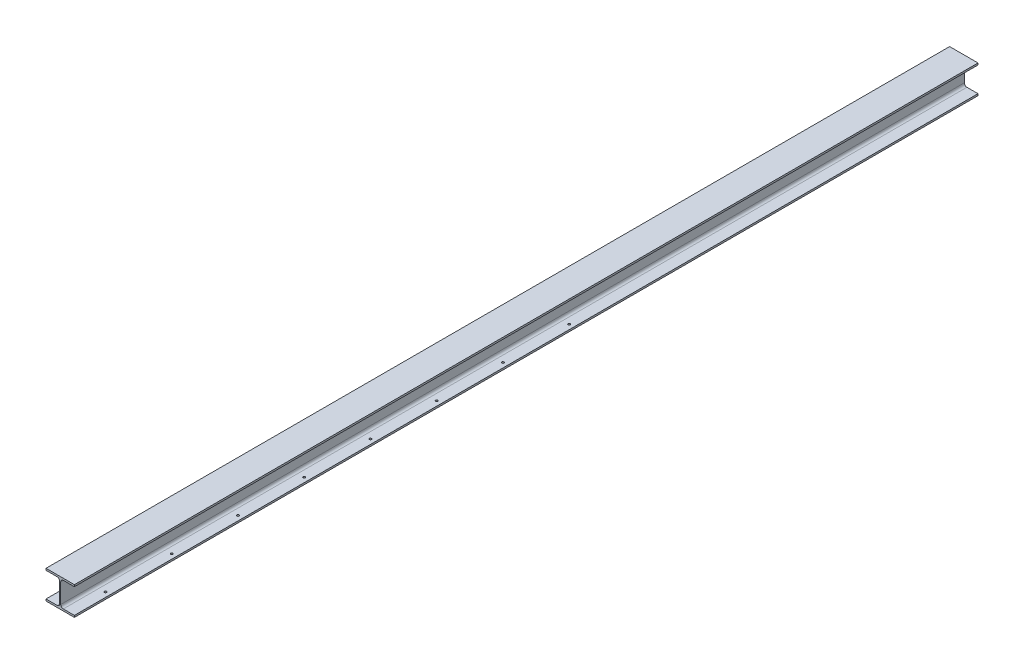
ISO-10303-21;
HEADER;
FILE_DESCRIPTION(('STEP AP214'),'2;1');
FILE_NAME('part.step','',(''),(''),'','','');
FILE_SCHEMA(('AUTOMOTIVE_DESIGN { 1 0 10303 214 1 1 1 1 }'));
ENDSEC;
DATA;
#1=APPLICATION_CONTEXT('core data for automotive mechanical design processes');
#2=APPLICATION_PROTOCOL_DEFINITION('international standard','automotive_design',2000,#1);
#3=PRODUCT_CONTEXT('',#1,'mechanical');
#4=PRODUCT('Part','Part','',(#3));
#5=PRODUCT_RELATED_PRODUCT_CATEGORY('part','',(#4));
#6=PRODUCT_DEFINITION_FORMATION('','',#4);
#7=PRODUCT_DEFINITION_CONTEXT('part definition',#1,'design');
#8=PRODUCT_DEFINITION('design','',#6,#7);
#9=PRODUCT_DEFINITION_SHAPE('','',#8);
#10=(LENGTH_UNIT() NAMED_UNIT(*) SI_UNIT(.MILLI.,.METRE.));
#11=(NAMED_UNIT(*) PLANE_ANGLE_UNIT() SI_UNIT($,.RADIAN.));
#12=(NAMED_UNIT(*) SI_UNIT($,.STERADIAN.) SOLID_ANGLE_UNIT());
#13=UNCERTAINTY_MEASURE_WITH_UNIT(LENGTH_MEASURE(1.E-05),#10,'distance_accuracy_value','');
#14=(GEOMETRIC_REPRESENTATION_CONTEXT(3) GLOBAL_UNCERTAINTY_ASSIGNED_CONTEXT((#13)) GLOBAL_UNIT_ASSIGNED_CONTEXT((#10,
#11,#12)) REPRESENTATION_CONTEXT('',''));
#15=CARTESIAN_POINT('',(0.,0.,0.));
#16=DIRECTION('',(0.,0.,1.));
#17=DIRECTION('',(1.,0.,0.));
#18=AXIS2_PLACEMENT_3D('',#15,#16,#17);
#19=CARTESIAN_POINT('',(150.,19.0000000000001,4775.));
#20=DIRECTION('',(0.,-1.,0.));
#21=DIRECTION('',(1.,0.,0.));
#22=AXIS2_PLACEMENT_3D('',#19,#20,#21);
#23=PLANE('',#22);
#24=CARTESIAN_POINT('',(100.000000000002,19.0000000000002,-504.001924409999));
#25=DIRECTION('',(0.,-1.,0.));
#26=DIRECTION('',(1.,0.,0.));
#27=AXIS2_PLACEMENT_3D('',#24,#25,#26);
#28=CIRCLE('',#27,11.0000000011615);
#29=CARTESIAN_POINT('',(111.000000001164,19.0000000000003,-504.001924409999));
#30=VERTEX_POINT('',#29);
#31=EDGE_CURVE('E345',#30,#30,#28,.F.);
#32=ORIENTED_EDGE('',*,*,#31,.F.);
#33=EDGE_LOOP('',(#32));
#34=FACE_BOUND('',#33,.T.);
#35=CARTESIAN_POINT('',(100.000000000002,19.0000000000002,195.998075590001));
#36=DIRECTION('',(0.,-1.,0.));
#37=DIRECTION('',(1.,0.,0.));
#38=AXIS2_PLACEMENT_3D('',#35,#36,#37);
#39=CIRCLE('',#38,11.0000000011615);
#40=CARTESIAN_POINT('',(111.000000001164,19.0000000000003,195.998075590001));
#41=VERTEX_POINT('',#40);
#42=EDGE_CURVE('E349',#41,#41,#39,.F.);
#43=ORIENTED_EDGE('',*,*,#42,.F.);
#44=EDGE_LOOP('',(#43));
#45=FACE_BOUND('',#44,.T.);
#46=CARTESIAN_POINT('',(100.000000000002,19.0000000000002,895.998075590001));
#47=DIRECTION('',(0.,-1.,0.));
#48=DIRECTION('',(1.,0.,0.));
#49=AXIS2_PLACEMENT_3D('',#46,#47,#48);
#50=CIRCLE('',#49,11.0000000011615);
#51=CARTESIAN_POINT('',(111.000000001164,19.0000000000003,895.998075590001));
#52=VERTEX_POINT('',#51);
#53=EDGE_CURVE('E353',#52,#52,#50,.F.);
#54=ORIENTED_EDGE('',*,*,#53,.F.);
#55=EDGE_LOOP('',(#54));
#56=FACE_BOUND('',#55,.T.);
#57=CARTESIAN_POINT('',(100.000000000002,19.0000000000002,1595.99807559));
#58=DIRECTION('',(0.,-1.,0.));
#59=DIRECTION('',(1.,0.,0.));
#60=AXIS2_PLACEMENT_3D('',#57,#58,#59);
#61=CIRCLE('',#60,11.0000000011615);
#62=CARTESIAN_POINT('',(111.000000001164,19.0000000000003,1595.99807559));
#63=VERTEX_POINT('',#62);
#64=EDGE_CURVE('E357',#63,#63,#61,.F.);
#65=ORIENTED_EDGE('',*,*,#64,.F.);
#66=EDGE_LOOP('',(#65));
#67=FACE_BOUND('',#66,.T.);
#68=CARTESIAN_POINT('',(100.000000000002,19.0000000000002,2295.99807559));
#69=DIRECTION('',(0.,-1.,0.));
#70=DIRECTION('',(1.,0.,0.));
#71=AXIS2_PLACEMENT_3D('',#68,#69,#70);
#72=CIRCLE('',#71,11.0000000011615);
#73=CARTESIAN_POINT('',(111.000000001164,19.0000000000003,2295.99807559));
#74=VERTEX_POINT('',#73);
#75=EDGE_CURVE('E361',#74,#74,#72,.F.);
#76=ORIENTED_EDGE('',*,*,#75,.F.);
#77=EDGE_LOOP('',(#76));
#78=FACE_BOUND('',#77,.T.);
#79=CARTESIAN_POINT('',(100.000000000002,19.0000000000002,2995.99807559));
#80=DIRECTION('',(0.,-1.,0.));
#81=DIRECTION('',(1.,0.,0.));
#82=AXIS2_PLACEMENT_3D('',#79,#80,#81);
#83=CIRCLE('',#82,11.0000000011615);
#84=CARTESIAN_POINT('',(111.000000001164,19.0000000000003,2995.99807559));
#85=VERTEX_POINT('',#84);
#86=EDGE_CURVE('E365',#85,#85,#83,.F.);
#87=ORIENTED_EDGE('',*,*,#86,.F.);
#88=EDGE_LOOP('',(#87));
#89=FACE_BOUND('',#88,.T.);
#90=CARTESIAN_POINT('',(100.000000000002,19.0000000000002,3695.99807559));
#91=DIRECTION('',(0.,-1.,0.));
#92=DIRECTION('',(1.,0.,0.));
#93=AXIS2_PLACEMENT_3D('',#90,#91,#92);
#94=CIRCLE('',#93,11.0000000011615);
#95=CARTESIAN_POINT('',(111.000000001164,19.0000000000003,3695.99807559));
#96=VERTEX_POINT('',#95);
#97=EDGE_CURVE('E369',#96,#96,#94,.F.);
#98=ORIENTED_EDGE('',*,*,#97,.F.);
#99=EDGE_LOOP('',(#98));
#100=FACE_BOUND('',#99,.T.);
#101=CARTESIAN_POINT('',(100.000000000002,19.0000000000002,4395.99807559));
#102=DIRECTION('',(0.,-1.,0.));
#103=DIRECTION('',(1.,0.,0.));
#104=AXIS2_PLACEMENT_3D('',#101,#102,#103);
#105=CIRCLE('',#104,11.0000000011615);
#106=CARTESIAN_POINT('',(111.000000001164,19.0000000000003,4395.99807559));
#107=VERTEX_POINT('',#106);
#108=EDGE_CURVE('E372',#107,#107,#105,.F.);
#109=ORIENTED_EDGE('',*,*,#108,.F.);
#110=EDGE_LOOP('',(#109));
#111=FACE_BOUND('',#110,.T.);
#112=DIRECTION('',(-1.,0.,0.));
#113=VECTOR('',#112,1.);
#114=CARTESIAN_POINT('',(150.,19.0000000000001,-4775.));
#115=LINE('',#114,#113);
#116=CARTESIAN_POINT('',(150.,19.0000000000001,-4775.));
#117=VERTEX_POINT('',#116);
#118=CARTESIAN_POINT('',(32.5,19.0000000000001,-4775.));
#119=VERTEX_POINT('',#118);
#120=EDGE_CURVE('E145',#117,#119,#115,.T.);
#121=ORIENTED_EDGE('',*,*,#120,.T.);
#122=DIRECTION('',(0.,0.,-1.));
#123=VECTOR('',#122,1.);
#124=CARTESIAN_POINT('',(32.5,19.0000000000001,4775.));
#125=LINE('',#124,#123);
#126=CARTESIAN_POINT('',(32.5,19.0000000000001,4775.));
#127=VERTEX_POINT('',#126);
#128=EDGE_CURVE('E11',#127,#119,#125,.T.);
#129=ORIENTED_EDGE('',*,*,#128,.F.);
#130=DIRECTION('',(-1.,0.,0.));
#131=VECTOR('',#130,1.);
#132=CARTESIAN_POINT('',(150.,19.0000000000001,4775.));
#133=LINE('',#132,#131);
#134=CARTESIAN_POINT('',(150.,19.0000000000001,4775.));
#135=VERTEX_POINT('',#134);
#136=EDGE_CURVE('E193',#135,#127,#133,.T.);
#137=ORIENTED_EDGE('',*,*,#136,.F.);
#138=DIRECTION('',(0.,0.,-1.));
#139=VECTOR('',#138,1.);
#140=CARTESIAN_POINT('',(150.,19.0000000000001,4775.));
#141=LINE('',#140,#139);
#142=EDGE_CURVE('E158',#135,#117,#141,.T.);
#143=ORIENTED_EDGE('',*,*,#142,.T.);
#144=EDGE_LOOP('',(#121,#129,#137,#143));
#145=FACE_BOUND('',#144,.T.);
#146=ADVANCED_FACE('F29',(#34,#45,#56,#67,#78,#89,#100,#111,#145),#23,.F.);
#147=CARTESIAN_POINT('',(32.5,46.0000000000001,4775.));
#148=DIRECTION('',(0.,0.,-1.));
#149=DIRECTION('',(-1.,0.,0.));
#150=AXIS2_PLACEMENT_3D('',#147,#148,#149);
#151=CYLINDRICAL_SURFACE('',#150,27.);
#152=CARTESIAN_POINT('',(32.5,46.0000000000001,-4775.));
#153=DIRECTION('',(0.,0.,-1.));
#154=DIRECTION('',(-1.,0.,0.));
#155=AXIS2_PLACEMENT_3D('',#152,#153,#154);
#156=CIRCLE('',#155,27.);
#157=CARTESIAN_POINT('',(5.49999999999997,46.0000000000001,-4775.));
#158=VERTEX_POINT('',#157);
#159=EDGE_CURVE('E141',#119,#158,#156,.T.);
#160=ORIENTED_EDGE('',*,*,#159,.T.);
#161=DIRECTION('',(0.,0.,-1.));
#162=VECTOR('',#161,1.);
#163=CARTESIAN_POINT('',(5.49999999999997,46.0000000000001,4775.));
#164=LINE('',#163,#162);
#165=CARTESIAN_POINT('',(5.49999999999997,46.0000000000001,4775.));
#166=VERTEX_POINT('',#165);
#167=EDGE_CURVE('E36',#166,#158,#164,.T.);
#168=ORIENTED_EDGE('',*,*,#167,.F.);
#169=CARTESIAN_POINT('',(32.5,46.0000000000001,4775.));
#170=DIRECTION('',(0.,0.,-1.));
#171=DIRECTION('',(-1.,0.,0.));
#172=AXIS2_PLACEMENT_3D('',#169,#170,#171);
#173=CIRCLE('',#172,27.);
#174=EDGE_CURVE('E154',#127,#166,#173,.T.);
#175=ORIENTED_EDGE('',*,*,#174,.F.);
#176=ORIENTED_EDGE('',*,*,#128,.T.);
#177=EDGE_LOOP('',(#160,#168,#175,#176));
#178=FACE_BOUND('',#177,.T.);
#179=ADVANCED_FACE('F153',(#178),#151,.F.);
#180=CARTESIAN_POINT('',(5.49999999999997,46.0000000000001,4775.));
#181=DIRECTION('',(-1.,0.,0.));
#182=DIRECTION('',(0.,0.,1.));
#183=AXIS2_PLACEMENT_3D('',#180,#181,#182);
#184=PLANE('',#183);
#185=DIRECTION('',(0.,1.,0.));
#186=VECTOR('',#185,1.);
#187=CARTESIAN_POINT('',(5.49999999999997,46.0000000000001,-4775.));
#188=LINE('',#187,#186);
#189=CARTESIAN_POINT('',(5.49999999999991,254.,-4775.));
#190=VERTEX_POINT('',#189);
#191=EDGE_CURVE('E147',#158,#190,#188,.T.);
#192=ORIENTED_EDGE('',*,*,#191,.T.);
#193=DIRECTION('',(0.,0.,-1.));
#194=VECTOR('',#193,1.);
#195=CARTESIAN_POINT('',(5.49999999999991,254.,4775.));
#196=LINE('',#195,#194);
#197=CARTESIAN_POINT('',(5.49999999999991,254.,4775.));
#198=VERTEX_POINT('',#197);
#199=EDGE_CURVE('E259',#198,#190,#196,.T.);
#200=ORIENTED_EDGE('',*,*,#199,.F.);
#201=DIRECTION('',(0.,1.,0.));
#202=VECTOR('',#201,1.);
#203=CARTESIAN_POINT('',(5.49999999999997,46.0000000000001,4775.));
#204=LINE('',#203,#202);
#205=EDGE_CURVE('E196',#166,#198,#204,.T.);
#206=ORIENTED_EDGE('',*,*,#205,.F.);
#207=ORIENTED_EDGE('',*,*,#167,.T.);
#208=EDGE_LOOP('',(#192,#200,#206,#207));
#209=FACE_BOUND('',#208,.T.);
#210=ADVANCED_FACE('F263',(#209),#184,.F.);
#211=CARTESIAN_POINT('',(32.4999999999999,254.,4775.));
#212=DIRECTION('',(0.,0.,-1.));
#213=DIRECTION('',(-1.,0.,0.));
#214=AXIS2_PLACEMENT_3D('',#211,#212,#213);
#215=CYLINDRICAL_SURFACE('',#214,27.);
#216=CARTESIAN_POINT('',(32.4999999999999,254.,-4775.));
#217=DIRECTION('',(0.,0.,-1.));
#218=DIRECTION('',(1.,0.,0.));
#219=AXIS2_PLACEMENT_3D('',#216,#217,#218);
#220=CIRCLE('',#219,27.);
#221=CARTESIAN_POINT('',(32.4999999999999,281.,-4775.));
#222=VERTEX_POINT('',#221);
#223=EDGE_CURVE('E167',#190,#222,#220,.T.);
#224=ORIENTED_EDGE('',*,*,#223,.T.);
#225=DIRECTION('',(0.,0.,-1.));
#226=VECTOR('',#225,1.);
#227=CARTESIAN_POINT('',(32.4999999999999,281.,4775.));
#228=LINE('',#227,#226);
#229=CARTESIAN_POINT('',(32.4999999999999,281.,4775.));
#230=VERTEX_POINT('',#229);
#231=EDGE_CURVE('E256',#230,#222,#228,.T.);
#232=ORIENTED_EDGE('',*,*,#231,.F.);
#233=CARTESIAN_POINT('',(32.4999999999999,254.,4775.));
#234=DIRECTION('',(0.,0.,-1.));
#235=DIRECTION('',(1.,0.,0.));
#236=AXIS2_PLACEMENT_3D('',#233,#234,#235);
#237=CIRCLE('',#236,27.);
#238=EDGE_CURVE('E198',#198,#230,#237,.T.);
#239=ORIENTED_EDGE('',*,*,#238,.F.);
#240=ORIENTED_EDGE('',*,*,#199,.T.);
#241=EDGE_LOOP('',(#224,#232,#239,#240));
#242=FACE_BOUND('',#241,.T.);
#243=ADVANCED_FACE('F271',(#242),#215,.F.);
#244=CARTESIAN_POINT('',(32.4999999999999,281.,4775.));
#245=DIRECTION('',(0.,1.,0.));
#246=DIRECTION('',(0.,0.,1.));
#247=AXIS2_PLACEMENT_3D('',#244,#245,#246);
#248=PLANE('',#247);
#249=DIRECTION('',(1.,0.,0.));
#250=VECTOR('',#249,1.);
#251=CARTESIAN_POINT('',(32.4999999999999,281.,-4775.));
#252=LINE('',#251,#250);
#253=CARTESIAN_POINT('',(150.,281.,-4775.));
#254=VERTEX_POINT('',#253);
#255=EDGE_CURVE('E169',#222,#254,#252,.T.);
#256=ORIENTED_EDGE('',*,*,#255,.T.);
#257=DIRECTION('',(0.,0.,-1.));
#258=VECTOR('',#257,1.);
#259=CARTESIAN_POINT('',(150.,281.,4775.));
#260=LINE('',#259,#258);
#261=CARTESIAN_POINT('',(150.,281.,4775.));
#262=VERTEX_POINT('',#261);
#263=EDGE_CURVE('E253',#262,#254,#260,.T.);
#264=ORIENTED_EDGE('',*,*,#263,.F.);
#265=DIRECTION('',(1.,0.,0.));
#266=VECTOR('',#265,1.);
#267=CARTESIAN_POINT('',(32.4999999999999,281.,4775.));
#268=LINE('',#267,#266);
#269=EDGE_CURVE('E200',#230,#262,#268,.T.);
#270=ORIENTED_EDGE('',*,*,#269,.F.);
#271=ORIENTED_EDGE('',*,*,#231,.T.);
#272=EDGE_LOOP('',(#256,#264,#270,#271));
#273=FACE_BOUND('',#272,.T.);
#274=ADVANCED_FACE('F274',(#273),#248,.F.);
#275=CARTESIAN_POINT('',(150.,281.,4775.));
#276=DIRECTION('',(-1.,0.,0.));
#277=DIRECTION('',(0.,-1.,0.));
#278=AXIS2_PLACEMENT_3D('',#275,#276,#277);
#279=PLANE('',#278);
#280=DIRECTION('',(0.,1.,0.));
#281=VECTOR('',#280,1.);
#282=CARTESIAN_POINT('',(150.,281.,-4775.));
#283=LINE('',#282,#281);
#284=CARTESIAN_POINT('',(150.,300.,-4775.));
#285=VERTEX_POINT('',#284);
#286=EDGE_CURVE('E171',#254,#285,#283,.T.);
#287=ORIENTED_EDGE('',*,*,#286,.T.);
#288=DIRECTION('',(0.,0.,-1.));
#289=VECTOR('',#288,1.);
#290=CARTESIAN_POINT('',(150.,300.,4775.));
#291=LINE('',#290,#289);
#292=CARTESIAN_POINT('',(150.,300.,4775.));
#293=VERTEX_POINT('',#292);
#294=EDGE_CURVE('E250',#293,#285,#291,.T.);
#295=ORIENTED_EDGE('',*,*,#294,.F.);
#296=DIRECTION('',(0.,1.,0.));
#297=VECTOR('',#296,1.);
#298=CARTESIAN_POINT('',(150.,281.,4775.));
#299=LINE('',#298,#297);
#300=EDGE_CURVE('E202',#262,#293,#299,.T.);
#301=ORIENTED_EDGE('',*,*,#300,.F.);
#302=ORIENTED_EDGE('',*,*,#263,.T.);
#303=EDGE_LOOP('',(#287,#295,#301,#302));
#304=FACE_BOUND('',#303,.T.);
#305=ADVANCED_FACE('F279',(#304),#279,.F.);
#306=CARTESIAN_POINT('',(150.,300.,4775.));
#307=DIRECTION('',(0.,-1.,0.));
#308=DIRECTION('',(0.,0.,-1.));
#309=AXIS2_PLACEMENT_3D('',#306,#307,#308);
#310=PLANE('',#309);
#311=DIRECTION('',(-1.,0.,0.));
#312=VECTOR('',#311,1.);
#313=CARTESIAN_POINT('',(150.,300.,-4775.));
#314=LINE('',#313,#312);
#315=CARTESIAN_POINT('',(-150.,300.,-4775.));
#316=VERTEX_POINT('',#315);
#317=EDGE_CURVE('E173',#285,#316,#314,.T.);
#318=ORIENTED_EDGE('',*,*,#317,.T.);
#319=DIRECTION('',(0.,0.,-1.));
#320=VECTOR('',#319,1.);
#321=CARTESIAN_POINT('',(-150.,300.,4775.));
#322=LINE('',#321,#320);
#323=CARTESIAN_POINT('',(-150.,300.,4775.));
#324=VERTEX_POINT('',#323);
#325=EDGE_CURVE('E247',#324,#316,#322,.T.);
#326=ORIENTED_EDGE('',*,*,#325,.F.);
#327=DIRECTION('',(-1.,0.,0.));
#328=VECTOR('',#327,1.);
#329=CARTESIAN_POINT('',(150.,300.,4775.));
#330=LINE('',#329,#328);
#331=EDGE_CURVE('E204',#293,#324,#330,.T.);
#332=ORIENTED_EDGE('',*,*,#331,.F.);
#333=ORIENTED_EDGE('',*,*,#294,.T.);
#334=EDGE_LOOP('',(#318,#326,#332,#333));
#335=FACE_BOUND('',#334,.T.);
#336=ADVANCED_FACE('F285',(#335),#310,.F.);
#337=CARTESIAN_POINT('',(-150.,281.,4775.));
#338=DIRECTION('',(1.,0.,0.));
#339=DIRECTION('',(0.,1.,0.));
#340=AXIS2_PLACEMENT_3D('',#337,#338,#339);
#341=PLANE('',#340);
#342=DIRECTION('',(0.,-1.,0.));
#343=VECTOR('',#342,1.);
#344=CARTESIAN_POINT('',(-150.,281.,-4775.));
#345=LINE('',#344,#343);
#346=CARTESIAN_POINT('',(-150.,281.,-4775.));
#347=VERTEX_POINT('',#346);
#348=EDGE_CURVE('E175',#316,#347,#345,.T.);
#349=ORIENTED_EDGE('',*,*,#348,.T.);
#350=DIRECTION('',(0.,0.,-1.));
#351=VECTOR('',#350,1.);
#352=CARTESIAN_POINT('',(-150.,281.,4775.));
#353=LINE('',#352,#351);
#354=CARTESIAN_POINT('',(-150.,281.,4775.));
#355=VERTEX_POINT('',#354);
#356=EDGE_CURVE('E244',#355,#347,#353,.T.);
#357=ORIENTED_EDGE('',*,*,#356,.F.);
#358=DIRECTION('',(0.,-1.,0.));
#359=VECTOR('',#358,1.);
#360=CARTESIAN_POINT('',(-150.,281.,4775.));
#361=LINE('',#360,#359);
#362=EDGE_CURVE('E206',#324,#355,#361,.T.);
#363=ORIENTED_EDGE('',*,*,#362,.F.);
#364=ORIENTED_EDGE('',*,*,#325,.T.);
#365=EDGE_LOOP('',(#349,#357,#363,#364));
#366=FACE_BOUND('',#365,.T.);
#367=ADVANCED_FACE('F289',(#366),#341,.F.);
#368=CARTESIAN_POINT('',(-32.5000000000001,281.,4775.));
#369=DIRECTION('',(0.,1.,0.));
#370=DIRECTION('',(-1.,0.,0.));
#371=AXIS2_PLACEMENT_3D('',#368,#369,#370);
#372=PLANE('',#371);
#373=DIRECTION('',(1.,0.,0.));
#374=VECTOR('',#373,1.);
#375=CARTESIAN_POINT('',(-32.5000000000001,281.,-4775.));
#376=LINE('',#375,#374);
#377=CARTESIAN_POINT('',(-32.5000000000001,281.,-4775.));
#378=VERTEX_POINT('',#377);
#379=EDGE_CURVE('E177',#347,#378,#376,.T.);
#380=ORIENTED_EDGE('',*,*,#379,.T.);
#381=DIRECTION('',(0.,0.,-1.));
#382=VECTOR('',#381,1.);
#383=CARTESIAN_POINT('',(-32.5000000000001,281.,4775.));
#384=LINE('',#383,#382);
#385=CARTESIAN_POINT('',(-32.5000000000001,281.,4775.));
#386=VERTEX_POINT('',#385);
#387=EDGE_CURVE('E241',#386,#378,#384,.T.);
#388=ORIENTED_EDGE('',*,*,#387,.F.);
#389=DIRECTION('',(1.,0.,0.));
#390=VECTOR('',#389,1.);
#391=CARTESIAN_POINT('',(-32.5000000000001,281.,4775.));
#392=LINE('',#391,#390);
#393=EDGE_CURVE('E208',#355,#386,#392,.T.);
#394=ORIENTED_EDGE('',*,*,#393,.F.);
#395=ORIENTED_EDGE('',*,*,#356,.T.);
#396=EDGE_LOOP('',(#380,#388,#394,#395));
#397=FACE_BOUND('',#396,.T.);
#398=ADVANCED_FACE('F294',(#397),#372,.F.);
#399=CARTESIAN_POINT('',(-32.5000000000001,254.,4775.));
#400=DIRECTION('',(0.,0.,-1.));
#401=DIRECTION('',(-1.,0.,0.));
#402=AXIS2_PLACEMENT_3D('',#399,#400,#401);
#403=CYLINDRICAL_SURFACE('',#402,27.);
#404=CARTESIAN_POINT('',(-32.5000000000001,254.,-4775.));
#405=DIRECTION('',(0.,0.,-1.));
#406=DIRECTION('',(1.,0.,0.));
#407=AXIS2_PLACEMENT_3D('',#404,#405,#406);
#408=CIRCLE('',#407,27.);
#409=CARTESIAN_POINT('',(-5.50000000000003,254.,-4775.));
#410=VERTEX_POINT('',#409);
#411=EDGE_CURVE('E179',#378,#410,#408,.T.);
#412=ORIENTED_EDGE('',*,*,#411,.T.);
#413=DIRECTION('',(0.,0.,-1.));
#414=VECTOR('',#413,1.);
#415=CARTESIAN_POINT('',(-5.50000000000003,254.,4775.));
#416=LINE('',#415,#414);
#417=CARTESIAN_POINT('',(-5.50000000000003,254.,4775.));
#418=VERTEX_POINT('',#417);
#419=EDGE_CURVE('E238',#418,#410,#416,.T.);
#420=ORIENTED_EDGE('',*,*,#419,.F.);
#421=CARTESIAN_POINT('',(-32.5000000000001,254.,4775.));
#422=DIRECTION('',(0.,0.,-1.));
#423=DIRECTION('',(1.,0.,0.));
#424=AXIS2_PLACEMENT_3D('',#421,#422,#423);
#425=CIRCLE('',#424,27.);
#426=EDGE_CURVE('E210',#386,#418,#425,.T.);
#427=ORIENTED_EDGE('',*,*,#426,.F.);
#428=ORIENTED_EDGE('',*,*,#387,.T.);
#429=EDGE_LOOP('',(#412,#420,#427,#428));
#430=FACE_BOUND('',#429,.T.);
#431=ADVANCED_FACE('F300',(#430),#403,.F.);
#432=CARTESIAN_POINT('',(-5.50000000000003,46.0000000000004,4775.));
#433=DIRECTION('',(1.,0.,0.));
#434=DIRECTION('',(0.,0.,-1.));
#435=AXIS2_PLACEMENT_3D('',#432,#433,#434);
#436=PLANE('',#435);
#437=DIRECTION('',(0.,-1.,0.));
#438=VECTOR('',#437,1.);
#439=CARTESIAN_POINT('',(-5.50000000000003,46.0000000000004,-4775.));
#440=LINE('',#439,#438);
#441=CARTESIAN_POINT('',(-5.50000000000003,46.0000000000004,-4775.));
#442=VERTEX_POINT('',#441);
#443=EDGE_CURVE('E181',#410,#442,#440,.T.);
#444=ORIENTED_EDGE('',*,*,#443,.T.);
#445=DIRECTION('',(0.,0.,-1.));
#446=VECTOR('',#445,1.);
#447=CARTESIAN_POINT('',(-5.50000000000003,46.0000000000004,4775.));
#448=LINE('',#447,#446);
#449=CARTESIAN_POINT('',(-5.50000000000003,46.0000000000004,4775.));
#450=VERTEX_POINT('',#449);
#451=EDGE_CURVE('E235',#450,#442,#448,.T.);
#452=ORIENTED_EDGE('',*,*,#451,.F.);
#453=DIRECTION('',(0.,-1.,0.));
#454=VECTOR('',#453,1.);
#455=CARTESIAN_POINT('',(-5.50000000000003,46.0000000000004,4775.));
#456=LINE('',#455,#454);
#457=EDGE_CURVE('E212',#418,#450,#456,.T.);
#458=ORIENTED_EDGE('',*,*,#457,.F.);
#459=ORIENTED_EDGE('',*,*,#419,.T.);
#460=EDGE_LOOP('',(#444,#452,#458,#459));
#461=FACE_BOUND('',#460,.T.);
#462=ADVANCED_FACE('F304',(#461),#436,.F.);
#463=CARTESIAN_POINT('',(-32.5,46.0000000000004,4775.));
#464=DIRECTION('',(0.,0.,-1.));
#465=DIRECTION('',(-1.,0.,0.));
#466=AXIS2_PLACEMENT_3D('',#463,#464,#465);
#467=CYLINDRICAL_SURFACE('',#466,27.);
#468=CARTESIAN_POINT('',(-32.5,46.0000000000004,-4775.));
#469=DIRECTION('',(0.,0.,-1.));
#470=DIRECTION('',(1.,0.,0.));
#471=AXIS2_PLACEMENT_3D('',#468,#469,#470);
#472=CIRCLE('',#471,27.);
#473=CARTESIAN_POINT('',(-32.4999999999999,19.0000000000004,-4775.));
#474=VERTEX_POINT('',#473);
#475=EDGE_CURVE('E183',#442,#474,#472,.T.);
#476=ORIENTED_EDGE('',*,*,#475,.T.);
#477=DIRECTION('',(0.,0.,-1.));
#478=VECTOR('',#477,1.);
#479=CARTESIAN_POINT('',(-32.4999999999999,19.0000000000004,4775.));
#480=LINE('',#479,#478);
#481=CARTESIAN_POINT('',(-32.4999999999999,19.0000000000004,4775.));
#482=VERTEX_POINT('',#481);
#483=EDGE_CURVE('E232',#482,#474,#480,.T.);
#484=ORIENTED_EDGE('',*,*,#483,.F.);
#485=CARTESIAN_POINT('',(-32.5,46.0000000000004,4775.));
#486=DIRECTION('',(0.,0.,-1.));
#487=DIRECTION('',(1.,0.,0.));
#488=AXIS2_PLACEMENT_3D('',#485,#486,#487);
#489=CIRCLE('',#488,27.);
#490=EDGE_CURVE('E214',#450,#482,#489,.T.);
#491=ORIENTED_EDGE('',*,*,#490,.F.);
#492=ORIENTED_EDGE('',*,*,#451,.T.);
#493=EDGE_LOOP('',(#476,#484,#491,#492));
#494=FACE_BOUND('',#493,.T.);
#495=ADVANCED_FACE('F309',(#494),#467,.F.);
#496=CARTESIAN_POINT('',(-150.,19.0000000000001,4775.));
#497=DIRECTION('',(0.,-1.,0.));
#498=DIRECTION('',(1.,0.,0.));
#499=AXIS2_PLACEMENT_3D('',#496,#497,#498);
#500=PLANE('',#499);
#501=CARTESIAN_POINT('',(-99.9999999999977,19.0000000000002,-504.001924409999));
#502=DIRECTION('',(0.,-1.,0.));
#503=DIRECTION('',(1.,0.,0.));
#504=AXIS2_PLACEMENT_3D('',#501,#502,#503);
#505=CIRCLE('',#504,11.0000000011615);
#506=CARTESIAN_POINT('',(-88.9999999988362,19.0000000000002,-504.001924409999));
#507=VERTEX_POINT('',#506);
#508=EDGE_CURVE('E676',#507,#507,#505,.F.);
#509=ORIENTED_EDGE('',*,*,#508,.F.);
#510=EDGE_LOOP('',(#509));
#511=FACE_BOUND('',#510,.T.);
#512=CARTESIAN_POINT('',(-99.9999999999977,19.0000000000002,195.998075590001));
#513=DIRECTION('',(0.,-1.,0.));
#514=DIRECTION('',(1.,0.,0.));
#515=AXIS2_PLACEMENT_3D('',#512,#513,#514);
#516=CIRCLE('',#515,11.0000000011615);
#517=CARTESIAN_POINT('',(-88.9999999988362,19.0000000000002,195.998075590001));
#518=VERTEX_POINT('',#517);
#519=EDGE_CURVE('E680',#518,#518,#516,.F.);
#520=ORIENTED_EDGE('',*,*,#519,.F.);
#521=EDGE_LOOP('',(#520));
#522=FACE_BOUND('',#521,.T.);
#523=CARTESIAN_POINT('',(-99.9999999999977,19.0000000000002,895.998075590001));
#524=DIRECTION('',(0.,-1.,0.));
#525=DIRECTION('',(1.,0.,0.));
#526=AXIS2_PLACEMENT_3D('',#523,#524,#525);
#527=CIRCLE('',#526,11.0000000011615);
#528=CARTESIAN_POINT('',(-88.9999999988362,19.0000000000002,895.998075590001));
#529=VERTEX_POINT('',#528);
#530=EDGE_CURVE('E689',#529,#529,#527,.F.);
#531=ORIENTED_EDGE('',*,*,#530,.F.);
#532=EDGE_LOOP('',(#531));
#533=FACE_BOUND('',#532,.T.);
#534=CARTESIAN_POINT('',(-99.9999999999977,19.0000000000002,1595.99807559));
#535=DIRECTION('',(0.,-1.,0.));
#536=DIRECTION('',(1.,0.,0.));
#537=AXIS2_PLACEMENT_3D('',#534,#535,#536);
#538=CIRCLE('',#537,11.0000000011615);
#539=CARTESIAN_POINT('',(-88.9999999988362,19.0000000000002,1595.99807559));
#540=VERTEX_POINT('',#539);
#541=EDGE_CURVE('E695',#540,#540,#538,.F.);
#542=ORIENTED_EDGE('',*,*,#541,.F.);
#543=EDGE_LOOP('',(#542));
#544=FACE_BOUND('',#543,.T.);
#545=CARTESIAN_POINT('',(-99.9999999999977,19.0000000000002,2295.99807559));
#546=DIRECTION('',(0.,-1.,0.));
#547=DIRECTION('',(1.,0.,0.));
#548=AXIS2_PLACEMENT_3D('',#545,#546,#547);
#549=CIRCLE('',#548,11.0000000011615);
#550=CARTESIAN_POINT('',(-88.9999999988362,19.0000000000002,2295.99807559));
#551=VERTEX_POINT('',#550);
#552=EDGE_CURVE('E701',#551,#551,#549,.F.);
#553=ORIENTED_EDGE('',*,*,#552,.F.);
#554=EDGE_LOOP('',(#553));
#555=FACE_BOUND('',#554,.T.);
#556=CARTESIAN_POINT('',(-99.9999999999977,19.0000000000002,2995.99807559));
#557=DIRECTION('',(0.,-1.,0.));
#558=DIRECTION('',(1.,0.,0.));
#559=AXIS2_PLACEMENT_3D('',#556,#557,#558);
#560=CIRCLE('',#559,11.0000000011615);
#561=CARTESIAN_POINT('',(-88.9999999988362,19.0000000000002,2995.99807559));
#562=VERTEX_POINT('',#561);
#563=EDGE_CURVE('E707',#562,#562,#560,.F.);
#564=ORIENTED_EDGE('',*,*,#563,.F.);
#565=EDGE_LOOP('',(#564));
#566=FACE_BOUND('',#565,.T.);
#567=CARTESIAN_POINT('',(-99.9999999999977,19.0000000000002,3695.99807559));
#568=DIRECTION('',(0.,-1.,0.));
#569=DIRECTION('',(1.,0.,0.));
#570=AXIS2_PLACEMENT_3D('',#567,#568,#569);
#571=CIRCLE('',#570,11.0000000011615);
#572=CARTESIAN_POINT('',(-88.9999999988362,19.0000000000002,3695.99807559));
#573=VERTEX_POINT('',#572);
#574=EDGE_CURVE('E713',#573,#573,#571,.F.);
#575=ORIENTED_EDGE('',*,*,#574,.F.);
#576=EDGE_LOOP('',(#575));
#577=FACE_BOUND('',#576,.T.);
#578=CARTESIAN_POINT('',(-99.9999999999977,19.0000000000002,-254.001924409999));
#579=DIRECTION('',(0.,-1.,0.));
#580=DIRECTION('',(1.,0.,0.));
#581=AXIS2_PLACEMENT_3D('',#578,#579,#580);
#582=CIRCLE('',#581,11.0000000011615);
#583=CARTESIAN_POINT('',(-88.9999999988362,19.0000000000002,-254.001924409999));
#584=VERTEX_POINT('',#583);
#585=EDGE_CURVE('E719',#584,#584,#582,.F.);
#586=ORIENTED_EDGE('',*,*,#585,.F.);
#587=EDGE_LOOP('',(#586));
#588=FACE_BOUND('',#587,.T.);
#589=CARTESIAN_POINT('',(-99.9999999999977,19.0000000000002,445.998075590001));
#590=DIRECTION('',(0.,-1.,0.));
#591=DIRECTION('',(1.,0.,0.));
#592=AXIS2_PLACEMENT_3D('',#589,#590,#591);
#593=CIRCLE('',#592,11.0000000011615);
#594=CARTESIAN_POINT('',(-88.9999999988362,19.0000000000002,445.998075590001));
#595=VERTEX_POINT('',#594);
#596=EDGE_CURVE('E725',#595,#595,#593,.F.);
#597=ORIENTED_EDGE('',*,*,#596,.F.);
#598=EDGE_LOOP('',(#597));
#599=FACE_BOUND('',#598,.T.);
#600=CARTESIAN_POINT('',(-99.9999999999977,19.0000000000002,1145.99807559));
#601=DIRECTION('',(0.,-1.,0.));
#602=DIRECTION('',(1.,0.,0.));
#603=AXIS2_PLACEMENT_3D('',#600,#601,#602);
#604=CIRCLE('',#603,11.0000000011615);
#605=CARTESIAN_POINT('',(-88.9999999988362,19.0000000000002,1145.99807559));
#606=VERTEX_POINT('',#605);
#607=EDGE_CURVE('E731',#606,#606,#604,.F.);
#608=ORIENTED_EDGE('',*,*,#607,.F.);
#609=EDGE_LOOP('',(#608));
#610=FACE_BOUND('',#609,.T.);
#611=CARTESIAN_POINT('',(-99.9999999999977,19.0000000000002,1845.99807559));
#612=DIRECTION('',(0.,-1.,0.));
#613=DIRECTION('',(1.,0.,0.));
#614=AXIS2_PLACEMENT_3D('',#611,#612,#613);
#615=CIRCLE('',#614,11.0000000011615);
#616=CARTESIAN_POINT('',(-88.9999999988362,19.0000000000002,1845.99807559));
#617=VERTEX_POINT('',#616);
#618=EDGE_CURVE('E737',#617,#617,#615,.F.);
#619=ORIENTED_EDGE('',*,*,#618,.F.);
#620=EDGE_LOOP('',(#619));
#621=FACE_BOUND('',#620,.T.);
#622=CARTESIAN_POINT('',(-99.9999999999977,19.0000000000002,2545.99807559));
#623=DIRECTION('',(0.,-1.,0.));
#624=DIRECTION('',(1.,0.,0.));
#625=AXIS2_PLACEMENT_3D('',#622,#623,#624);
#626=CIRCLE('',#625,11.0000000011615);
#627=CARTESIAN_POINT('',(-88.9999999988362,19.0000000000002,2545.99807559));
#628=VERTEX_POINT('',#627);
#629=EDGE_CURVE('E743',#628,#628,#626,.F.);
#630=ORIENTED_EDGE('',*,*,#629,.F.);
#631=EDGE_LOOP('',(#630));
#632=FACE_BOUND('',#631,.T.);
#633=CARTESIAN_POINT('',(-99.9999999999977,19.0000000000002,3245.99807559));
#634=DIRECTION('',(0.,-1.,0.));
#635=DIRECTION('',(1.,0.,0.));
#636=AXIS2_PLACEMENT_3D('',#633,#634,#635);
#637=CIRCLE('',#636,11.0000000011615);
#638=CARTESIAN_POINT('',(-88.9999999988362,19.0000000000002,3245.99807559));
#639=VERTEX_POINT('',#638);
#640=EDGE_CURVE('E749',#639,#639,#637,.F.);
#641=ORIENTED_EDGE('',*,*,#640,.F.);
#642=EDGE_LOOP('',(#641));
#643=FACE_BOUND('',#642,.T.);
#644=CARTESIAN_POINT('',(-99.9999999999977,19.0000000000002,3945.99807559));
#645=DIRECTION('',(0.,-1.,0.));
#646=DIRECTION('',(1.,0.,0.));
#647=AXIS2_PLACEMENT_3D('',#644,#645,#646);
#648=CIRCLE('',#647,11.0000000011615);
#649=CARTESIAN_POINT('',(-88.9999999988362,19.0000000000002,3945.99807559));
#650=VERTEX_POINT('',#649);
#651=EDGE_CURVE('E755',#650,#650,#648,.F.);
#652=ORIENTED_EDGE('',*,*,#651,.F.);
#653=EDGE_LOOP('',(#652));
#654=FACE_BOUND('',#653,.T.);
#655=CARTESIAN_POINT('',(-99.9999999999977,19.0000000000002,4395.99807559));
#656=DIRECTION('',(0.,-1.,0.));
#657=DIRECTION('',(1.,0.,0.));
#658=AXIS2_PLACEMENT_3D('',#655,#656,#657);
#659=CIRCLE('',#658,11.0000000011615);
#660=CARTESIAN_POINT('',(-88.9999999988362,19.0000000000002,4395.99807559));
#661=VERTEX_POINT('',#660);
#662=EDGE_CURVE('E378',#661,#661,#659,.F.);
#663=ORIENTED_EDGE('',*,*,#662,.F.);
#664=EDGE_LOOP('',(#663));
#665=FACE_BOUND('',#664,.T.);
#666=CARTESIAN_POINT('',(-99.9999999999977,19.0000000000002,4645.99807559));
#667=DIRECTION('',(0.,-1.,0.));
#668=DIRECTION('',(1.,0.,0.));
#669=AXIS2_PLACEMENT_3D('',#666,#667,#668);
#670=CIRCLE('',#669,11.0000000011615);
#671=CARTESIAN_POINT('',(-88.9999999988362,19.0000000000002,4645.99807559));
#672=VERTEX_POINT('',#671);
#673=EDGE_CURVE('E162',#672,#672,#670,.F.);
#674=ORIENTED_EDGE('',*,*,#673,.F.);
#675=EDGE_LOOP('',(#674));
#676=FACE_BOUND('',#675,.T.);
#677=DIRECTION('',(-1.,0.,0.));
#678=VECTOR('',#677,1.);
#679=CARTESIAN_POINT('',(-150.,19.0000000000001,-4775.));
#680=LINE('',#679,#678);
#681=CARTESIAN_POINT('',(-150.,19.0000000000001,-4775.));
#682=VERTEX_POINT('',#681);
#683=EDGE_CURVE('E185',#474,#682,#680,.T.);
#684=ORIENTED_EDGE('',*,*,#683,.T.);
#685=DIRECTION('',(0.,0.,-1.));
#686=VECTOR('',#685,1.);
#687=CARTESIAN_POINT('',(-150.,19.0000000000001,4775.));
#688=LINE('',#687,#686);
#689=CARTESIAN_POINT('',(-150.,19.0000000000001,4775.));
#690=VERTEX_POINT('',#689);
#691=EDGE_CURVE('E229',#690,#682,#688,.T.);
#692=ORIENTED_EDGE('',*,*,#691,.F.);
#693=DIRECTION('',(-1.,0.,0.));
#694=VECTOR('',#693,1.);
#695=CARTESIAN_POINT('',(-150.,19.0000000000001,4775.));
#696=LINE('',#695,#694);
#697=EDGE_CURVE('E216',#482,#690,#696,.T.);
#698=ORIENTED_EDGE('',*,*,#697,.F.);
#699=ORIENTED_EDGE('',*,*,#483,.T.);
#700=EDGE_LOOP('',(#684,#692,#698,#699));
#701=FACE_BOUND('',#700,.T.);
#702=ADVANCED_FACE('F315',(#511,#522,#533,#544,#555,#566,#577,#588,#599,#610,#621,#632,#643,
#654,#665,#676,#701),#500,.F.);
#703=CARTESIAN_POINT('',(-150.,0.,4775.));
#704=DIRECTION('',(1.,0.,0.));
#705=DIRECTION('',(0.,1.,0.));
#706=AXIS2_PLACEMENT_3D('',#703,#704,#705);
#707=PLANE('',#706);
#708=DIRECTION('',(0.,-1.,0.));
#709=VECTOR('',#708,1.);
#710=CARTESIAN_POINT('',(-150.,0.,-4775.));
#711=LINE('',#710,#709);
#712=CARTESIAN_POINT('',(-150.,0.,-4775.));
#713=VERTEX_POINT('',#712);
#714=EDGE_CURVE('E187',#682,#713,#711,.T.);
#715=ORIENTED_EDGE('',*,*,#714,.T.);
#716=DIRECTION('',(0.,0.,-1.));
#717=VECTOR('',#716,1.);
#718=CARTESIAN_POINT('',(-150.,0.,4775.));
#719=LINE('',#718,#717);
#720=CARTESIAN_POINT('',(-150.,0.,4775.));
#721=VERTEX_POINT('',#720);
#722=EDGE_CURVE('E226',#721,#713,#719,.T.);
#723=ORIENTED_EDGE('',*,*,#722,.F.);
#724=DIRECTION('',(0.,-1.,0.));
#725=VECTOR('',#724,1.);
#726=CARTESIAN_POINT('',(-150.,0.,4775.));
#727=LINE('',#726,#725);
#728=EDGE_CURVE('E218',#690,#721,#727,.T.);
#729=ORIENTED_EDGE('',*,*,#728,.F.);
#730=ORIENTED_EDGE('',*,*,#691,.T.);
#731=EDGE_LOOP('',(#715,#723,#729,#730));
#732=FACE_BOUND('',#731,.T.);
#733=ADVANCED_FACE('F319',(#732),#707,.F.);
#734=CARTESIAN_POINT('',(-150.,0.,4775.));
#735=DIRECTION('',(0.,1.,0.));
#736=DIRECTION('',(-1.,0.,0.));
#737=AXIS2_PLACEMENT_3D('',#734,#735,#736);
#738=PLANE('',#737);
#739=CARTESIAN_POINT('',(-99.9999999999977,0.,-504.001924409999));
#740=DIRECTION('',(0.,-1.,0.));
#741=DIRECTION('',(1.,0.,0.));
#742=AXIS2_PLACEMENT_3D('',#739,#740,#741);
#743=CIRCLE('',#742,11.0000000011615);
#744=CARTESIAN_POINT('',(-88.9999999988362,0.,-504.001924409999));
#745=VERTEX_POINT('',#744);
#746=EDGE_CURVE('E674',#745,#745,#743,.T.);
#747=ORIENTED_EDGE('',*,*,#746,.F.);
#748=EDGE_LOOP('',(#747));
#749=FACE_BOUND('',#748,.T.);
#750=CARTESIAN_POINT('',(-99.9999999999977,0.,195.998075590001));
#751=DIRECTION('',(0.,-1.,0.));
#752=DIRECTION('',(1.,0.,0.));
#753=AXIS2_PLACEMENT_3D('',#750,#751,#752);
#754=CIRCLE('',#753,11.0000000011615);
#755=CARTESIAN_POINT('',(-88.9999999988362,0.,195.998075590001));
#756=VERTEX_POINT('',#755);
#757=EDGE_CURVE('E677',#756,#756,#754,.T.);
#758=ORIENTED_EDGE('',*,*,#757,.F.);
#759=EDGE_LOOP('',(#758));
#760=FACE_BOUND('',#759,.T.);
#761=CARTESIAN_POINT('',(-99.9999999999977,0.,895.998075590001));
#762=DIRECTION('',(0.,-1.,0.));
#763=DIRECTION('',(1.,0.,0.));
#764=AXIS2_PLACEMENT_3D('',#761,#762,#763);
#765=CIRCLE('',#764,11.0000000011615);
#766=CARTESIAN_POINT('',(-88.9999999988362,0.,895.998075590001));
#767=VERTEX_POINT('',#766);
#768=EDGE_CURVE('E686',#767,#767,#765,.T.);
#769=ORIENTED_EDGE('',*,*,#768,.F.);
#770=EDGE_LOOP('',(#769));
#771=FACE_BOUND('',#770,.T.);
#772=CARTESIAN_POINT('',(-99.9999999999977,0.,1595.99807559));
#773=DIRECTION('',(0.,-1.,0.));
#774=DIRECTION('',(1.,0.,0.));
#775=AXIS2_PLACEMENT_3D('',#772,#773,#774);
#776=CIRCLE('',#775,11.0000000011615);
#777=CARTESIAN_POINT('',(-88.9999999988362,0.,1595.99807559));
#778=VERTEX_POINT('',#777);
#779=EDGE_CURVE('E692',#778,#778,#776,.T.);
#780=ORIENTED_EDGE('',*,*,#779,.F.);
#781=EDGE_LOOP('',(#780));
#782=FACE_BOUND('',#781,.T.);
#783=CARTESIAN_POINT('',(-99.9999999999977,0.,2295.99807559));
#784=DIRECTION('',(0.,-1.,0.));
#785=DIRECTION('',(1.,0.,0.));
#786=AXIS2_PLACEMENT_3D('',#783,#784,#785);
#787=CIRCLE('',#786,11.0000000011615);
#788=CARTESIAN_POINT('',(-88.9999999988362,0.,2295.99807559));
#789=VERTEX_POINT('',#788);
#790=EDGE_CURVE('E698',#789,#789,#787,.T.);
#791=ORIENTED_EDGE('',*,*,#790,.F.);
#792=EDGE_LOOP('',(#791));
#793=FACE_BOUND('',#792,.T.);
#794=CARTESIAN_POINT('',(-99.9999999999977,0.,2995.99807559));
#795=DIRECTION('',(0.,-1.,0.));
#796=DIRECTION('',(1.,0.,0.));
#797=AXIS2_PLACEMENT_3D('',#794,#795,#796);
#798=CIRCLE('',#797,11.0000000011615);
#799=CARTESIAN_POINT('',(-88.9999999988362,0.,2995.99807559));
#800=VERTEX_POINT('',#799);
#801=EDGE_CURVE('E704',#800,#800,#798,.T.);
#802=ORIENTED_EDGE('',*,*,#801,.F.);
#803=EDGE_LOOP('',(#802));
#804=FACE_BOUND('',#803,.T.);
#805=CARTESIAN_POINT('',(-99.9999999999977,0.,3695.99807559));
#806=DIRECTION('',(0.,-1.,0.));
#807=DIRECTION('',(1.,0.,0.));
#808=AXIS2_PLACEMENT_3D('',#805,#806,#807);
#809=CIRCLE('',#808,11.0000000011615);
#810=CARTESIAN_POINT('',(-88.9999999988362,0.,3695.99807559));
#811=VERTEX_POINT('',#810);
#812=EDGE_CURVE('E710',#811,#811,#809,.T.);
#813=ORIENTED_EDGE('',*,*,#812,.F.);
#814=EDGE_LOOP('',(#813));
#815=FACE_BOUND('',#814,.T.);
#816=CARTESIAN_POINT('',(-99.9999999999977,0.,-254.001924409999));
#817=DIRECTION('',(0.,-1.,0.));
#818=DIRECTION('',(1.,0.,0.));
#819=AXIS2_PLACEMENT_3D('',#816,#817,#818);
#820=CIRCLE('',#819,11.0000000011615);
#821=CARTESIAN_POINT('',(-88.9999999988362,0.,-254.001924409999));
#822=VERTEX_POINT('',#821);
#823=EDGE_CURVE('E716',#822,#822,#820,.T.);
#824=ORIENTED_EDGE('',*,*,#823,.F.);
#825=EDGE_LOOP('',(#824));
#826=FACE_BOUND('',#825,.T.);
#827=CARTESIAN_POINT('',(-99.9999999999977,0.,445.998075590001));
#828=DIRECTION('',(0.,-1.,0.));
#829=DIRECTION('',(1.,0.,0.));
#830=AXIS2_PLACEMENT_3D('',#827,#828,#829);
#831=CIRCLE('',#830,11.0000000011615);
#832=CARTESIAN_POINT('',(-88.9999999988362,0.,445.998075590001));
#833=VERTEX_POINT('',#832);
#834=EDGE_CURVE('E722',#833,#833,#831,.T.);
#835=ORIENTED_EDGE('',*,*,#834,.F.);
#836=EDGE_LOOP('',(#835));
#837=FACE_BOUND('',#836,.T.);
#838=CARTESIAN_POINT('',(-99.9999999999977,0.,1145.99807559));
#839=DIRECTION('',(0.,-1.,0.));
#840=DIRECTION('',(1.,0.,0.));
#841=AXIS2_PLACEMENT_3D('',#838,#839,#840);
#842=CIRCLE('',#841,11.0000000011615);
#843=CARTESIAN_POINT('',(-88.9999999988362,0.,1145.99807559));
#844=VERTEX_POINT('',#843);
#845=EDGE_CURVE('E728',#844,#844,#842,.T.);
#846=ORIENTED_EDGE('',*,*,#845,.F.);
#847=EDGE_LOOP('',(#846));
#848=FACE_BOUND('',#847,.T.);
#849=CARTESIAN_POINT('',(-99.9999999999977,0.,1845.99807559));
#850=DIRECTION('',(0.,-1.,0.));
#851=DIRECTION('',(1.,0.,0.));
#852=AXIS2_PLACEMENT_3D('',#849,#850,#851);
#853=CIRCLE('',#852,11.0000000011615);
#854=CARTESIAN_POINT('',(-88.9999999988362,0.,1845.99807559));
#855=VERTEX_POINT('',#854);
#856=EDGE_CURVE('E734',#855,#855,#853,.T.);
#857=ORIENTED_EDGE('',*,*,#856,.F.);
#858=EDGE_LOOP('',(#857));
#859=FACE_BOUND('',#858,.T.);
#860=CARTESIAN_POINT('',(-99.9999999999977,0.,2545.99807559));
#861=DIRECTION('',(0.,-1.,0.));
#862=DIRECTION('',(1.,0.,0.));
#863=AXIS2_PLACEMENT_3D('',#860,#861,#862);
#864=CIRCLE('',#863,11.0000000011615);
#865=CARTESIAN_POINT('',(-88.9999999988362,0.,2545.99807559));
#866=VERTEX_POINT('',#865);
#867=EDGE_CURVE('E740',#866,#866,#864,.T.);
#868=ORIENTED_EDGE('',*,*,#867,.F.);
#869=EDGE_LOOP('',(#868));
#870=FACE_BOUND('',#869,.T.);
#871=CARTESIAN_POINT('',(-99.9999999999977,0.,3245.99807559));
#872=DIRECTION('',(0.,-1.,0.));
#873=DIRECTION('',(1.,0.,0.));
#874=AXIS2_PLACEMENT_3D('',#871,#872,#873);
#875=CIRCLE('',#874,11.0000000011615);
#876=CARTESIAN_POINT('',(-88.9999999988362,0.,3245.99807559));
#877=VERTEX_POINT('',#876);
#878=EDGE_CURVE('E746',#877,#877,#875,.T.);
#879=ORIENTED_EDGE('',*,*,#878,.F.);
#880=EDGE_LOOP('',(#879));
#881=FACE_BOUND('',#880,.T.);
#882=CARTESIAN_POINT('',(-99.9999999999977,0.,3945.99807559));
#883=DIRECTION('',(0.,-1.,0.));
#884=DIRECTION('',(1.,0.,0.));
#885=AXIS2_PLACEMENT_3D('',#882,#883,#884);
#886=CIRCLE('',#885,11.0000000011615);
#887=CARTESIAN_POINT('',(-88.9999999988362,0.,3945.99807559));
#888=VERTEX_POINT('',#887);
#889=EDGE_CURVE('E752',#888,#888,#886,.T.);
#890=ORIENTED_EDGE('',*,*,#889,.F.);
#891=EDGE_LOOP('',(#890));
#892=FACE_BOUND('',#891,.T.);
#893=CARTESIAN_POINT('',(100.000000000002,0.,-504.001924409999));
#894=DIRECTION('',(0.,-1.,0.));
#895=DIRECTION('',(1.,0.,0.));
#896=AXIS2_PLACEMENT_3D('',#893,#894,#895);
#897=CIRCLE('',#896,11.0000000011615);
#898=CARTESIAN_POINT('',(111.000000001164,0.,-504.001924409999));
#899=VERTEX_POINT('',#898);
#900=EDGE_CURVE('E758',#899,#899,#897,.T.);
#901=ORIENTED_EDGE('',*,*,#900,.F.);
#902=EDGE_LOOP('',(#901));
#903=FACE_BOUND('',#902,.T.);
#904=CARTESIAN_POINT('',(100.000000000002,0.,195.998075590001));
#905=DIRECTION('',(0.,-1.,0.));
#906=DIRECTION('',(1.,0.,0.));
#907=AXIS2_PLACEMENT_3D('',#904,#905,#906);
#908=CIRCLE('',#907,11.0000000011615);
#909=CARTESIAN_POINT('',(111.000000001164,0.,195.998075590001));
#910=VERTEX_POINT('',#909);
#911=EDGE_CURVE('E762',#910,#910,#908,.T.);
#912=ORIENTED_EDGE('',*,*,#911,.F.);
#913=EDGE_LOOP('',(#912));
#914=FACE_BOUND('',#913,.T.);
#915=CARTESIAN_POINT('',(100.000000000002,0.,895.998075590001));
#916=DIRECTION('',(0.,-1.,0.));
#917=DIRECTION('',(1.,0.,0.));
#918=AXIS2_PLACEMENT_3D('',#915,#916,#917);
#919=CIRCLE('',#918,11.0000000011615);
#920=CARTESIAN_POINT('',(111.000000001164,0.,895.998075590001));
#921=VERTEX_POINT('',#920);
#922=EDGE_CURVE('E766',#921,#921,#919,.T.);
#923=ORIENTED_EDGE('',*,*,#922,.F.);
#924=EDGE_LOOP('',(#923));
#925=FACE_BOUND('',#924,.T.);
#926=CARTESIAN_POINT('',(100.000000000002,0.,1595.99807559));
#927=DIRECTION('',(0.,-1.,0.));
#928=DIRECTION('',(1.,0.,0.));
#929=AXIS2_PLACEMENT_3D('',#926,#927,#928);
#930=CIRCLE('',#929,11.0000000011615);
#931=CARTESIAN_POINT('',(111.000000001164,0.,1595.99807559));
#932=VERTEX_POINT('',#931);
#933=EDGE_CURVE('E770',#932,#932,#930,.T.);
#934=ORIENTED_EDGE('',*,*,#933,.F.);
#935=EDGE_LOOP('',(#934));
#936=FACE_BOUND('',#935,.T.);
#937=CARTESIAN_POINT('',(100.000000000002,0.,2295.99807559));
#938=DIRECTION('',(0.,-1.,0.));
#939=DIRECTION('',(1.,0.,0.));
#940=AXIS2_PLACEMENT_3D('',#937,#938,#939);
#941=CIRCLE('',#940,11.0000000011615);
#942=CARTESIAN_POINT('',(111.000000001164,0.,2295.99807559));
#943=VERTEX_POINT('',#942);
#944=EDGE_CURVE('E774',#943,#943,#941,.T.);
#945=ORIENTED_EDGE('',*,*,#944,.F.);
#946=EDGE_LOOP('',(#945));
#947=FACE_BOUND('',#946,.T.);
#948=CARTESIAN_POINT('',(100.000000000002,0.,2995.99807559));
#949=DIRECTION('',(0.,-1.,0.));
#950=DIRECTION('',(1.,0.,0.));
#951=AXIS2_PLACEMENT_3D('',#948,#949,#950);
#952=CIRCLE('',#951,11.0000000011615);
#953=CARTESIAN_POINT('',(111.000000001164,0.,2995.99807559));
#954=VERTEX_POINT('',#953);
#955=EDGE_CURVE('E778',#954,#954,#952,.T.);
#956=ORIENTED_EDGE('',*,*,#955,.F.);
#957=EDGE_LOOP('',(#956));
#958=FACE_BOUND('',#957,.T.);
#959=CARTESIAN_POINT('',(100.000000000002,0.,3695.99807559));
#960=DIRECTION('',(0.,-1.,0.));
#961=DIRECTION('',(1.,0.,0.));
#962=AXIS2_PLACEMENT_3D('',#959,#960,#961);
#963=CIRCLE('',#962,11.0000000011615);
#964=CARTESIAN_POINT('',(111.000000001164,0.,3695.99807559));
#965=VERTEX_POINT('',#964);
#966=EDGE_CURVE('E782',#965,#965,#963,.T.);
#967=ORIENTED_EDGE('',*,*,#966,.F.);
#968=EDGE_LOOP('',(#967));
#969=FACE_BOUND('',#968,.T.);
#970=CARTESIAN_POINT('',(100.000000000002,0.,4395.99807559));
#971=DIRECTION('',(0.,-1.,0.));
#972=DIRECTION('',(1.,0.,0.));
#973=AXIS2_PLACEMENT_3D('',#970,#971,#972);
#974=CIRCLE('',#973,11.0000000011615);
#975=CARTESIAN_POINT('',(111.000000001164,0.,4395.99807559));
#976=VERTEX_POINT('',#975);
#977=EDGE_CURVE('E375',#976,#976,#974,.T.);
#978=ORIENTED_EDGE('',*,*,#977,.F.);
#979=EDGE_LOOP('',(#978));
#980=FACE_BOUND('',#979,.T.);
#981=CARTESIAN_POINT('',(-99.9999999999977,0.,4395.99807559));
#982=DIRECTION('',(0.,-1.,0.));
#983=DIRECTION('',(1.,0.,0.));
#984=AXIS2_PLACEMENT_3D('',#981,#982,#983);
#985=CIRCLE('',#984,11.0000000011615);
#986=CARTESIAN_POINT('',(-88.9999999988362,0.,4395.99807559));
#987=VERTEX_POINT('',#986);
#988=EDGE_CURVE('E374',#987,#987,#985,.T.);
#989=ORIENTED_EDGE('',*,*,#988,.F.);
#990=EDGE_LOOP('',(#989));
#991=FACE_BOUND('',#990,.T.);
#992=CARTESIAN_POINT('',(-99.9999999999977,0.,4645.99807559));
#993=DIRECTION('',(0.,-1.,0.));
#994=DIRECTION('',(1.,0.,0.));
#995=AXIS2_PLACEMENT_3D('',#992,#993,#994);
#996=CIRCLE('',#995,11.0000000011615);
#997=CARTESIAN_POINT('',(-88.9999999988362,0.,4645.99807559));
#998=VERTEX_POINT('',#997);
#999=EDGE_CURVE('E159',#998,#998,#996,.T.);
#1000=ORIENTED_EDGE('',*,*,#999,.F.);
#1001=EDGE_LOOP('',(#1000));
#1002=FACE_BOUND('',#1001,.T.);
#1003=DIRECTION('',(1.,0.,0.));
#1004=VECTOR('',#1003,1.);
#1005=CARTESIAN_POINT('',(-150.,0.,-4775.));
#1006=LINE('',#1005,#1004);
#1007=CARTESIAN_POINT('',(150.,1.19490964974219E-13,-4775.));
#1008=VERTEX_POINT('',#1007);
#1009=EDGE_CURVE('E189',#713,#1008,#1006,.T.);
#1010=ORIENTED_EDGE('',*,*,#1009,.T.);
#1011=DIRECTION('',(0.,0.,-1.));
#1012=VECTOR('',#1011,1.);
#1013=CARTESIAN_POINT('',(150.,1.19490964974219E-13,4775.));
#1014=LINE('',#1013,#1012);
#1015=CARTESIAN_POINT('',(150.,1.19490964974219E-13,4775.));
#1016=VERTEX_POINT('',#1015);
#1017=EDGE_CURVE('E223',#1016,#1008,#1014,.T.);
#1018=ORIENTED_EDGE('',*,*,#1017,.F.);
#1019=DIRECTION('',(1.,0.,0.));
#1020=VECTOR('',#1019,1.);
#1021=CARTESIAN_POINT('',(-150.,0.,4775.));
#1022=LINE('',#1021,#1020);
#1023=EDGE_CURVE('E48',#721,#1016,#1022,.T.);
#1024=ORIENTED_EDGE('',*,*,#1023,.F.);
#1025=ORIENTED_EDGE('',*,*,#722,.T.);
#1026=EDGE_LOOP('',(#1010,#1018,#1024,#1025));
#1027=FACE_BOUND('',#1026,.T.);
#1028=ADVANCED_FACE('F322',(#749,#760,#771,#782,#793,#804,#815,#826,#837,#848,#859,#870,#881,
#892,#903,#914,#925,#936,#947,#958,#969,#980,#991,#1002,#1027),#738,.F.);
#1029=CARTESIAN_POINT('',(150.,1.19490964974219E-13,4775.));
#1030=DIRECTION('',(-1.,0.,0.));
#1031=DIRECTION('',(0.,-1.,0.));
#1032=AXIS2_PLACEMENT_3D('',#1029,#1030,#1031);
#1033=PLANE('',#1032);
#1034=DIRECTION('',(0.,1.,0.));
#1035=VECTOR('',#1034,1.);
#1036=CARTESIAN_POINT('',(150.,1.19490964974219E-13,-4775.));
#1037=LINE('',#1036,#1035);
#1038=EDGE_CURVE('E191',#1008,#117,#1037,.T.);
#1039=ORIENTED_EDGE('',*,*,#1038,.T.);
#1040=ORIENTED_EDGE('',*,*,#142,.F.);
#1041=DIRECTION('',(0.,1.,0.));
#1042=VECTOR('',#1041,1.);
#1043=CARTESIAN_POINT('',(150.,1.19490964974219E-13,4775.));
#1044=LINE('',#1043,#1042);
#1045=EDGE_CURVE('E43',#1016,#135,#1044,.T.);
#1046=ORIENTED_EDGE('',*,*,#1045,.F.);
#1047=ORIENTED_EDGE('',*,*,#1017,.T.);
#1048=EDGE_LOOP('',(#1039,#1040,#1046,#1047));
#1049=FACE_BOUND('',#1048,.T.);
#1050=ADVANCED_FACE('F324',(#1049),#1033,.F.);
#1051=CARTESIAN_POINT('',(32.5,46.0000000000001,4775.));
#1052=DIRECTION('',(0.,0.,-1.));
#1053=DIRECTION('',(-1.,0.,0.));
#1054=AXIS2_PLACEMENT_3D('',#1051,#1052,#1053);
#1055=PLANE('',#1054);
#1056=ORIENTED_EDGE('',*,*,#136,.T.);
#1057=ORIENTED_EDGE('',*,*,#174,.T.);
#1058=ORIENTED_EDGE('',*,*,#205,.T.);
#1059=ORIENTED_EDGE('',*,*,#238,.T.);
#1060=ORIENTED_EDGE('',*,*,#269,.T.);
#1061=ORIENTED_EDGE('',*,*,#300,.T.);
#1062=ORIENTED_EDGE('',*,*,#331,.T.);
#1063=ORIENTED_EDGE('',*,*,#362,.T.);
#1064=ORIENTED_EDGE('',*,*,#393,.T.);
#1065=ORIENTED_EDGE('',*,*,#426,.T.);
#1066=ORIENTED_EDGE('',*,*,#457,.T.);
#1067=ORIENTED_EDGE('',*,*,#490,.T.);
#1068=ORIENTED_EDGE('',*,*,#697,.T.);
#1069=ORIENTED_EDGE('',*,*,#728,.T.);
#1070=ORIENTED_EDGE('',*,*,#1023,.T.);
#1071=ORIENTED_EDGE('',*,*,#1045,.T.);
#1072=EDGE_LOOP('',(#1056,#1057,#1058,#1059,#1060,#1061,#1062,#1063,#1064,#1065,#1066,#1067,
#1068,#1069,#1070,#1071));
#1073=FACE_BOUND('',#1072,.T.);
#1074=ADVANCED_FACE('F266',(#1073),#1055,.F.);
#1075=CARTESIAN_POINT('',(32.5,46.0000000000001,-4775.));
#1076=DIRECTION('',(0.,0.,-1.));
#1077=DIRECTION('',(-1.,0.,0.));
#1078=AXIS2_PLACEMENT_3D('',#1075,#1076,#1077);
#1079=PLANE('',#1078);
#1080=ORIENTED_EDGE('',*,*,#120,.F.);
#1081=ORIENTED_EDGE('',*,*,#1038,.F.);
#1082=ORIENTED_EDGE('',*,*,#1009,.F.);
#1083=ORIENTED_EDGE('',*,*,#714,.F.);
#1084=ORIENTED_EDGE('',*,*,#683,.F.);
#1085=ORIENTED_EDGE('',*,*,#475,.F.);
#1086=ORIENTED_EDGE('',*,*,#443,.F.);
#1087=ORIENTED_EDGE('',*,*,#411,.F.);
#1088=ORIENTED_EDGE('',*,*,#379,.F.);
#1089=ORIENTED_EDGE('',*,*,#348,.F.);
#1090=ORIENTED_EDGE('',*,*,#317,.F.);
#1091=ORIENTED_EDGE('',*,*,#286,.F.);
#1092=ORIENTED_EDGE('',*,*,#255,.F.);
#1093=ORIENTED_EDGE('',*,*,#223,.F.);
#1094=ORIENTED_EDGE('',*,*,#191,.F.);
#1095=ORIENTED_EDGE('',*,*,#159,.F.);
#1096=EDGE_LOOP('',(#1080,#1081,#1082,#1083,#1084,#1085,#1086,#1087,#1088,#1089,#1090,#1091,
#1092,#1093,#1094,#1095));
#1097=FACE_BOUND('',#1096,.T.);
#1098=ADVANCED_FACE('F142',(#1097),#1079,.T.);
#1099=CARTESIAN_POINT('',(-99.9999999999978,300.001,4645.99807559));
#1100=DIRECTION('',(0.,-1.,0.));
#1101=DIRECTION('',(1.,0.,0.));
#1102=AXIS2_PLACEMENT_3D('',#1099,#1100,#1101);
#1103=CYLINDRICAL_SURFACE('',#1102,11.0000000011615);
#1104=ORIENTED_EDGE('',*,*,#999,.T.);
#1105=EDGE_LOOP('',(#1104));
#1106=FACE_BOUND('',#1105,.T.);
#1107=ORIENTED_EDGE('',*,*,#673,.T.);
#1108=EDGE_LOOP('',(#1107));
#1109=FACE_BOUND('',#1108,.T.);
#1110=ADVANCED_FACE('F388',(#1106,#1109),#1103,.F.);
#1111=CARTESIAN_POINT('',(-99.9999999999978,300.001,4395.99807559));
#1112=DIRECTION('',(0.,-1.,0.));
#1113=DIRECTION('',(1.,0.,0.));
#1114=AXIS2_PLACEMENT_3D('',#1111,#1112,#1113);
#1115=CYLINDRICAL_SURFACE('',#1114,11.0000000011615);
#1116=ORIENTED_EDGE('',*,*,#988,.T.);
#1117=EDGE_LOOP('',(#1116));
#1118=FACE_BOUND('',#1117,.T.);
#1119=ORIENTED_EDGE('',*,*,#662,.T.);
#1120=EDGE_LOOP('',(#1119));
#1121=FACE_BOUND('',#1120,.T.);
#1122=ADVANCED_FACE('F487',(#1118,#1121),#1115,.F.);
#1123=CARTESIAN_POINT('',(100.000000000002,300.001,4395.99807559));
#1124=DIRECTION('',(0.,-1.,0.));
#1125=DIRECTION('',(1.,0.,0.));
#1126=AXIS2_PLACEMENT_3D('',#1123,#1124,#1125);
#1127=CYLINDRICAL_SURFACE('',#1126,11.0000000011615);
#1128=ORIENTED_EDGE('',*,*,#977,.T.);
#1129=EDGE_LOOP('',(#1128));
#1130=FACE_BOUND('',#1129,.T.);
#1131=ORIENTED_EDGE('',*,*,#108,.T.);
#1132=EDGE_LOOP('',(#1131));
#1133=FACE_BOUND('',#1132,.T.);
#1134=ADVANCED_FACE('F495',(#1130,#1133),#1127,.F.);
#1135=CARTESIAN_POINT('',(100.000000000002,300.001,3695.99807559));
#1136=DIRECTION('',(0.,-1.,0.));
#1137=DIRECTION('',(1.,0.,0.));
#1138=AXIS2_PLACEMENT_3D('',#1135,#1136,#1137);
#1139=CYLINDRICAL_SURFACE('',#1138,11.0000000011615);
#1140=ORIENTED_EDGE('',*,*,#966,.T.);
#1141=EDGE_LOOP('',(#1140));
#1142=FACE_BOUND('',#1141,.T.);
#1143=ORIENTED_EDGE('',*,*,#97,.T.);
#1144=EDGE_LOOP('',(#1143));
#1145=FACE_BOUND('',#1144,.T.);
#1146=ADVANCED_FACE('F502',(#1142,#1145),#1139,.F.);
#1147=CARTESIAN_POINT('',(100.000000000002,300.001,2995.99807559));
#1148=DIRECTION('',(0.,-1.,0.));
#1149=DIRECTION('',(1.,0.,0.));
#1150=AXIS2_PLACEMENT_3D('',#1147,#1148,#1149);
#1151=CYLINDRICAL_SURFACE('',#1150,11.0000000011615);
#1152=ORIENTED_EDGE('',*,*,#955,.T.);
#1153=EDGE_LOOP('',(#1152));
#1154=FACE_BOUND('',#1153,.T.);
#1155=ORIENTED_EDGE('',*,*,#86,.T.);
#1156=EDGE_LOOP('',(#1155));
#1157=FACE_BOUND('',#1156,.T.);
#1158=ADVANCED_FACE('F509',(#1154,#1157),#1151,.F.);
#1159=CARTESIAN_POINT('',(100.000000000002,300.001,2295.99807559));
#1160=DIRECTION('',(0.,-1.,0.));
#1161=DIRECTION('',(1.,0.,0.));
#1162=AXIS2_PLACEMENT_3D('',#1159,#1160,#1161);
#1163=CYLINDRICAL_SURFACE('',#1162,11.0000000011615);
#1164=ORIENTED_EDGE('',*,*,#944,.T.);
#1165=EDGE_LOOP('',(#1164));
#1166=FACE_BOUND('',#1165,.T.);
#1167=ORIENTED_EDGE('',*,*,#75,.T.);
#1168=EDGE_LOOP('',(#1167));
#1169=FACE_BOUND('',#1168,.T.);
#1170=ADVANCED_FACE('F517',(#1166,#1169),#1163,.F.);
#1171=CARTESIAN_POINT('',(100.000000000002,300.001,1595.99807559));
#1172=DIRECTION('',(0.,-1.,0.));
#1173=DIRECTION('',(1.,0.,0.));
#1174=AXIS2_PLACEMENT_3D('',#1171,#1172,#1173);
#1175=CYLINDRICAL_SURFACE('',#1174,11.0000000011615);
#1176=ORIENTED_EDGE('',*,*,#933,.T.);
#1177=EDGE_LOOP('',(#1176));
#1178=FACE_BOUND('',#1177,.T.);
#1179=ORIENTED_EDGE('',*,*,#64,.T.);
#1180=EDGE_LOOP('',(#1179));
#1181=FACE_BOUND('',#1180,.T.);
#1182=ADVANCED_FACE('F525',(#1178,#1181),#1175,.F.);
#1183=CARTESIAN_POINT('',(100.000000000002,300.001,895.998075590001));
#1184=DIRECTION('',(0.,-1.,0.));
#1185=DIRECTION('',(1.,0.,0.));
#1186=AXIS2_PLACEMENT_3D('',#1183,#1184,#1185);
#1187=CYLINDRICAL_SURFACE('',#1186,11.0000000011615);
#1188=ORIENTED_EDGE('',*,*,#922,.T.);
#1189=EDGE_LOOP('',(#1188));
#1190=FACE_BOUND('',#1189,.T.);
#1191=ORIENTED_EDGE('',*,*,#53,.T.);
#1192=EDGE_LOOP('',(#1191));
#1193=FACE_BOUND('',#1192,.T.);
#1194=ADVANCED_FACE('F533',(#1190,#1193),#1187,.F.);
#1195=CARTESIAN_POINT('',(100.000000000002,300.001,195.998075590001));
#1196=DIRECTION('',(0.,-1.,0.));
#1197=DIRECTION('',(1.,0.,0.));
#1198=AXIS2_PLACEMENT_3D('',#1195,#1196,#1197);
#1199=CYLINDRICAL_SURFACE('',#1198,11.0000000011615);
#1200=ORIENTED_EDGE('',*,*,#911,.T.);
#1201=EDGE_LOOP('',(#1200));
#1202=FACE_BOUND('',#1201,.T.);
#1203=ORIENTED_EDGE('',*,*,#42,.T.);
#1204=EDGE_LOOP('',(#1203));
#1205=FACE_BOUND('',#1204,.T.);
#1206=ADVANCED_FACE('F541',(#1202,#1205),#1199,.F.);
#1207=CARTESIAN_POINT('',(100.000000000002,300.001,-504.001924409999));
#1208=DIRECTION('',(0.,-1.,0.));
#1209=DIRECTION('',(1.,0.,0.));
#1210=AXIS2_PLACEMENT_3D('',#1207,#1208,#1209);
#1211=CYLINDRICAL_SURFACE('',#1210,11.0000000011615);
#1212=ORIENTED_EDGE('',*,*,#900,.T.);
#1213=EDGE_LOOP('',(#1212));
#1214=FACE_BOUND('',#1213,.T.);
#1215=ORIENTED_EDGE('',*,*,#31,.T.);
#1216=EDGE_LOOP('',(#1215));
#1217=FACE_BOUND('',#1216,.T.);
#1218=ADVANCED_FACE('F549',(#1214,#1217),#1211,.F.);
#1219=CARTESIAN_POINT('',(-99.9999999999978,300.001,3945.99807559));
#1220=DIRECTION('',(0.,-1.,0.));
#1221=DIRECTION('',(1.,0.,0.));
#1222=AXIS2_PLACEMENT_3D('',#1219,#1220,#1221);
#1223=CYLINDRICAL_SURFACE('',#1222,11.0000000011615);
#1224=ORIENTED_EDGE('',*,*,#889,.T.);
#1225=EDGE_LOOP('',(#1224));
#1226=FACE_BOUND('',#1225,.T.);
#1227=ORIENTED_EDGE('',*,*,#651,.T.);
#1228=EDGE_LOOP('',(#1227));
#1229=FACE_BOUND('',#1228,.T.);
#1230=ADVANCED_FACE('F557',(#1226,#1229),#1223,.F.);
#1231=CARTESIAN_POINT('',(-99.9999999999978,300.001,3245.99807559));
#1232=DIRECTION('',(0.,-1.,0.));
#1233=DIRECTION('',(1.,0.,0.));
#1234=AXIS2_PLACEMENT_3D('',#1231,#1232,#1233);
#1235=CYLINDRICAL_SURFACE('',#1234,11.0000000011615);
#1236=ORIENTED_EDGE('',*,*,#878,.T.);
#1237=EDGE_LOOP('',(#1236));
#1238=FACE_BOUND('',#1237,.T.);
#1239=ORIENTED_EDGE('',*,*,#640,.T.);
#1240=EDGE_LOOP('',(#1239));
#1241=FACE_BOUND('',#1240,.T.);
#1242=ADVANCED_FACE('F565',(#1238,#1241),#1235,.F.);
#1243=CARTESIAN_POINT('',(-99.9999999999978,300.001,2545.99807559));
#1244=DIRECTION('',(0.,-1.,0.));
#1245=DIRECTION('',(1.,0.,0.));
#1246=AXIS2_PLACEMENT_3D('',#1243,#1244,#1245);
#1247=CYLINDRICAL_SURFACE('',#1246,11.0000000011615);
#1248=ORIENTED_EDGE('',*,*,#867,.T.);
#1249=EDGE_LOOP('',(#1248));
#1250=FACE_BOUND('',#1249,.T.);
#1251=ORIENTED_EDGE('',*,*,#629,.T.);
#1252=EDGE_LOOP('',(#1251));
#1253=FACE_BOUND('',#1252,.T.);
#1254=ADVANCED_FACE('F573',(#1250,#1253),#1247,.F.);
#1255=CARTESIAN_POINT('',(-99.9999999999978,300.001,1845.99807559));
#1256=DIRECTION('',(0.,-1.,0.));
#1257=DIRECTION('',(1.,0.,0.));
#1258=AXIS2_PLACEMENT_3D('',#1255,#1256,#1257);
#1259=CYLINDRICAL_SURFACE('',#1258,11.0000000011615);
#1260=ORIENTED_EDGE('',*,*,#856,.T.);
#1261=EDGE_LOOP('',(#1260));
#1262=FACE_BOUND('',#1261,.T.);
#1263=ORIENTED_EDGE('',*,*,#618,.T.);
#1264=EDGE_LOOP('',(#1263));
#1265=FACE_BOUND('',#1264,.T.);
#1266=ADVANCED_FACE('F581',(#1262,#1265),#1259,.F.);
#1267=CARTESIAN_POINT('',(-99.9999999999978,300.001,1145.99807559));
#1268=DIRECTION('',(0.,-1.,0.));
#1269=DIRECTION('',(1.,0.,0.));
#1270=AXIS2_PLACEMENT_3D('',#1267,#1268,#1269);
#1271=CYLINDRICAL_SURFACE('',#1270,11.0000000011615);
#1272=ORIENTED_EDGE('',*,*,#845,.T.);
#1273=EDGE_LOOP('',(#1272));
#1274=FACE_BOUND('',#1273,.T.);
#1275=ORIENTED_EDGE('',*,*,#607,.T.);
#1276=EDGE_LOOP('',(#1275));
#1277=FACE_BOUND('',#1276,.T.);
#1278=ADVANCED_FACE('F589',(#1274,#1277),#1271,.F.);
#1279=CARTESIAN_POINT('',(-99.9999999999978,300.001,445.998075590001));
#1280=DIRECTION('',(0.,-1.,0.));
#1281=DIRECTION('',(1.,0.,0.));
#1282=AXIS2_PLACEMENT_3D('',#1279,#1280,#1281);
#1283=CYLINDRICAL_SURFACE('',#1282,11.0000000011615);
#1284=ORIENTED_EDGE('',*,*,#834,.T.);
#1285=EDGE_LOOP('',(#1284));
#1286=FACE_BOUND('',#1285,.T.);
#1287=ORIENTED_EDGE('',*,*,#596,.T.);
#1288=EDGE_LOOP('',(#1287));
#1289=FACE_BOUND('',#1288,.T.);
#1290=ADVANCED_FACE('F597',(#1286,#1289),#1283,.F.);
#1291=CARTESIAN_POINT('',(-99.9999999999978,300.001,-254.001924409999));
#1292=DIRECTION('',(0.,-1.,0.));
#1293=DIRECTION('',(1.,0.,0.));
#1294=AXIS2_PLACEMENT_3D('',#1291,#1292,#1293);
#1295=CYLINDRICAL_SURFACE('',#1294,11.0000000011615);
#1296=ORIENTED_EDGE('',*,*,#823,.T.);
#1297=EDGE_LOOP('',(#1296));
#1298=FACE_BOUND('',#1297,.T.);
#1299=ORIENTED_EDGE('',*,*,#585,.T.);
#1300=EDGE_LOOP('',(#1299));
#1301=FACE_BOUND('',#1300,.T.);
#1302=ADVANCED_FACE('F605',(#1298,#1301),#1295,.F.);
#1303=CARTESIAN_POINT('',(-99.9999999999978,300.001,3695.99807559));
#1304=DIRECTION('',(0.,-1.,0.));
#1305=DIRECTION('',(1.,0.,0.));
#1306=AXIS2_PLACEMENT_3D('',#1303,#1304,#1305);
#1307=CYLINDRICAL_SURFACE('',#1306,11.0000000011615);
#1308=ORIENTED_EDGE('',*,*,#812,.T.);
#1309=EDGE_LOOP('',(#1308));
#1310=FACE_BOUND('',#1309,.T.);
#1311=ORIENTED_EDGE('',*,*,#574,.T.);
#1312=EDGE_LOOP('',(#1311));
#1313=FACE_BOUND('',#1312,.T.);
#1314=ADVANCED_FACE('F613',(#1310,#1313),#1307,.F.);
#1315=CARTESIAN_POINT('',(-99.9999999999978,300.001,2995.99807559));
#1316=DIRECTION('',(0.,-1.,0.));
#1317=DIRECTION('',(1.,0.,0.));
#1318=AXIS2_PLACEMENT_3D('',#1315,#1316,#1317);
#1319=CYLINDRICAL_SURFACE('',#1318,11.0000000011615);
#1320=ORIENTED_EDGE('',*,*,#801,.T.);
#1321=EDGE_LOOP('',(#1320));
#1322=FACE_BOUND('',#1321,.T.);
#1323=ORIENTED_EDGE('',*,*,#563,.T.);
#1324=EDGE_LOOP('',(#1323));
#1325=FACE_BOUND('',#1324,.T.);
#1326=ADVANCED_FACE('F621',(#1322,#1325),#1319,.F.);
#1327=CARTESIAN_POINT('',(-99.9999999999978,300.001,2295.99807559));
#1328=DIRECTION('',(0.,-1.,0.));
#1329=DIRECTION('',(1.,0.,0.));
#1330=AXIS2_PLACEMENT_3D('',#1327,#1328,#1329);
#1331=CYLINDRICAL_SURFACE('',#1330,11.0000000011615);
#1332=ORIENTED_EDGE('',*,*,#790,.T.);
#1333=EDGE_LOOP('',(#1332));
#1334=FACE_BOUND('',#1333,.T.);
#1335=ORIENTED_EDGE('',*,*,#552,.T.);
#1336=EDGE_LOOP('',(#1335));
#1337=FACE_BOUND('',#1336,.T.);
#1338=ADVANCED_FACE('F629',(#1334,#1337),#1331,.F.);
#1339=CARTESIAN_POINT('',(-99.9999999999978,300.001,1595.99807559));
#1340=DIRECTION('',(0.,-1.,0.));
#1341=DIRECTION('',(1.,0.,0.));
#1342=AXIS2_PLACEMENT_3D('',#1339,#1340,#1341);
#1343=CYLINDRICAL_SURFACE('',#1342,11.0000000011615);
#1344=ORIENTED_EDGE('',*,*,#779,.T.);
#1345=EDGE_LOOP('',(#1344));
#1346=FACE_BOUND('',#1345,.T.);
#1347=ORIENTED_EDGE('',*,*,#541,.T.);
#1348=EDGE_LOOP('',(#1347));
#1349=FACE_BOUND('',#1348,.T.);
#1350=ADVANCED_FACE('F637',(#1346,#1349),#1343,.F.);
#1351=CARTESIAN_POINT('',(-99.9999999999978,300.001,895.998075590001));
#1352=DIRECTION('',(0.,-1.,0.));
#1353=DIRECTION('',(1.,0.,0.));
#1354=AXIS2_PLACEMENT_3D('',#1351,#1352,#1353);
#1355=CYLINDRICAL_SURFACE('',#1354,11.0000000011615);
#1356=ORIENTED_EDGE('',*,*,#768,.T.);
#1357=EDGE_LOOP('',(#1356));
#1358=FACE_BOUND('',#1357,.T.);
#1359=ORIENTED_EDGE('',*,*,#530,.T.);
#1360=EDGE_LOOP('',(#1359));
#1361=FACE_BOUND('',#1360,.T.);
#1362=ADVANCED_FACE('F645',(#1358,#1361),#1355,.F.);
#1363=CARTESIAN_POINT('',(-99.9999999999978,300.001,195.998075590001));
#1364=DIRECTION('',(0.,-1.,0.));
#1365=DIRECTION('',(1.,0.,0.));
#1366=AXIS2_PLACEMENT_3D('',#1363,#1364,#1365);
#1367=CYLINDRICAL_SURFACE('',#1366,11.0000000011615);
#1368=ORIENTED_EDGE('',*,*,#757,.T.);
#1369=EDGE_LOOP('',(#1368));
#1370=FACE_BOUND('',#1369,.T.);
#1371=ORIENTED_EDGE('',*,*,#519,.T.);
#1372=EDGE_LOOP('',(#1371));
#1373=FACE_BOUND('',#1372,.T.);
#1374=ADVANCED_FACE('F653',(#1370,#1373),#1367,.F.);
#1375=CARTESIAN_POINT('',(-99.9999999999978,300.001,-504.001924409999));
#1376=DIRECTION('',(0.,-1.,0.));
#1377=DIRECTION('',(1.,0.,0.));
#1378=AXIS2_PLACEMENT_3D('',#1375,#1376,#1377);
#1379=CYLINDRICAL_SURFACE('',#1378,11.0000000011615);
#1380=ORIENTED_EDGE('',*,*,#746,.T.);
#1381=EDGE_LOOP('',(#1380));
#1382=FACE_BOUND('',#1381,.T.);
#1383=ORIENTED_EDGE('',*,*,#508,.T.);
#1384=EDGE_LOOP('',(#1383));
#1385=FACE_BOUND('',#1384,.T.);
#1386=ADVANCED_FACE('F661',(#1382,#1385),#1379,.F.);
#1387=CLOSED_SHELL('',(#146,#179,#210,#243,#274,#305,#336,#367,#398,#431,#462,#495,#702,#733,
#1028,#1050,#1074,#1098,#1110,#1122,#1134,#1146,#1158,#1170,#1182,#1194,#1206,#1218,#1230,#1242,
#1254,#1266,#1278,#1290,#1302,#1314,#1326,#1338,#1350,#1362,#1374,#1386));
#1388=MANIFOLD_SOLID_BREP('B2',#1387);
#1389=ADVANCED_BREP_SHAPE_REPRESENTATION('',(#18,#1388),#14);
#1390=SHAPE_DEFINITION_REPRESENTATION(#9,#1389);
ENDSEC;
END-ISO-10303-21;
